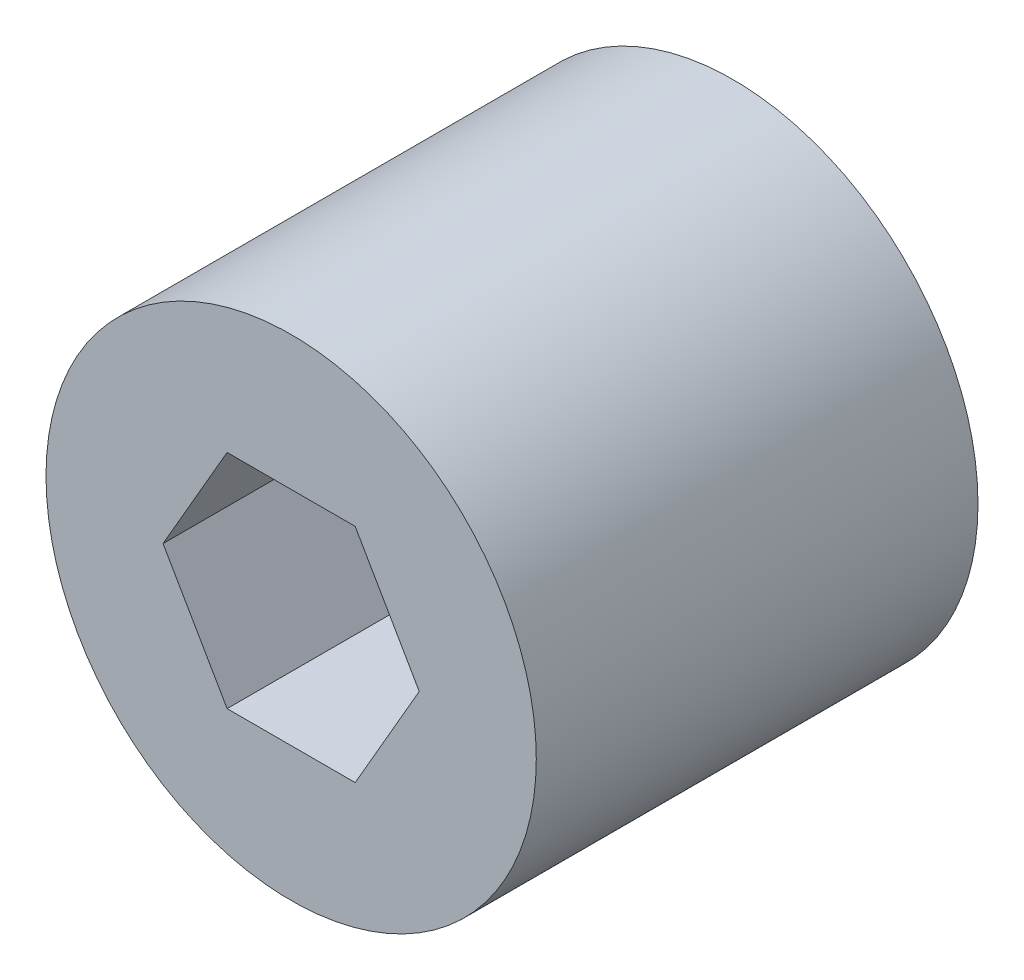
from build123d import *

# Parameters (mm, degrees)
SKETCH1_R           = 14.097
BOSS_EXTRUDE1_DEPTH = 25.4


with BuildPart() as part:
    # Sketch1 → Boss-Extrude1 (new body)
    with BuildSketch(Plane.XY):
        Circle(SKETCH1_R)
        Polygon((-3.683, 6.379143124), (3.683, 6.379143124), (7.366, 0), (3.683, -6.379143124), (-3.683, -6.379143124), (-7.366, 0), align=None, mode=Mode.SUBTRACT)
    extrude(amount=BOSS_EXTRUDE1_DEPTH)


solid = part.part
